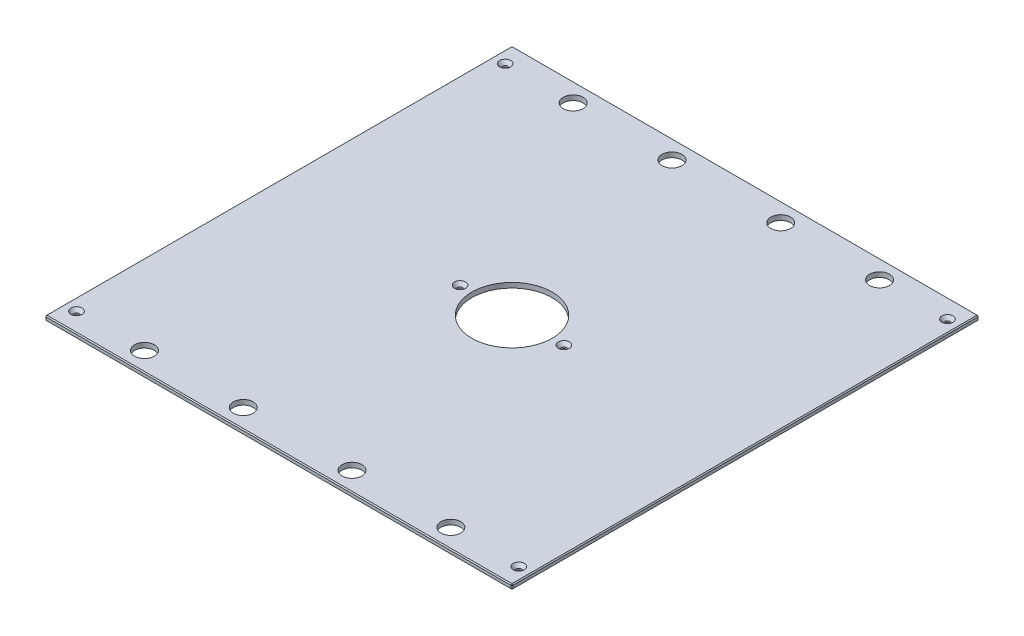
from build123d import *

# Parameters (mm, degrees)
SKETCH1_W                                     = 600.075
SKETCH1_H                                     = 600.075
BOSS_EXTRUDE1_DEPTH                           = 6.35
SKETCH13_R                                    = 51.562
CUT_EXTRUDE6_DEPTH                            = 425.364613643
F_1_1_DIAMETER_HOLE1_D                        = 25.4
CHAMFER2_SIZE                                 = 1.27
CSK_FOR_1_4_FLAT_HEAD_MACHINE_SCREW1_AT_COUNT = 2
CSK_FOR_1_4_FLAT_HEAD_MACHINE_SCREW1_AT_PITCH = 550.85996
CSK_FOR_1_4_FLAT_HEAD_MACHINE_SCREW1_2_COUNT  = 2
CSK_FOR_1_4_FLAT_HEAD_MACHINE_SCREW1_2_PITCH  = 791.479627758
CSK_FOR_1_4_FLAT_HEAD_MACHINE_SCREW1_3_COUNT  = 2
CSK_FOR_1_4_FLAT_HEAD_MACHINE_SCREW1_3_PITCH  = 446.036573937
CSK_FOR_1_4_FLAT_HEAD_MACHINE_SCREW1_4_COUNT  = 2
CSK_FOR_1_4_FLAT_HEAD_MACHINE_SCREW1_4_PITCH  = 350.945133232
CSK_FOR_1_4_FLAT_HEAD_MACHINE_SCREW1_5_COUNT  = 2
CSK_FOR_1_4_FLAT_HEAD_MACHINE_SCREW1_5_PITCH  = 568.325
CSK_FOR_1_4_FLAT_HEAD_MACHINE_SCREW1_6_COUNT  = 2
CSK_FOR_1_4_FLAT_HEAD_MACHINE_SCREW1_6_PITCH  = 481.0125
CSK_FOR_1_4_FLAT_HEAD_MACHINE_SCREW1_7_COUNT  = 2
CSK_FOR_1_4_FLAT_HEAD_MACHINE_SCREW1_7_PITCH  = 731.313695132


with BuildPart() as part:
    # Sketch1 → Boss-Extrude1 (new body)
    with BuildSketch(Plane(origin=(0, 0, 0), x_dir=(1, 0, 0), z_dir=(0, 1, 0))):
        Rectangle(SKETCH1_W, SKETCH1_H)
    extrude(amount=BOSS_EXTRUDE1_DEPTH)

    # Sketch13 → Cut-Extrude6 (cut, through all)
    with BuildSketch(Plane(origin=(0, 6.35, 0), x_dir=(1, 0, 0), z_dir=(0, 1, 0))):
        with Locations(Location((0, 0, 0), (0, 0, 270))):
            Circle(SKETCH13_R)
    extrude(amount=-CUT_EXTRUDE6_DEPTH, mode=Mode.SUBTRACT)

    # 1 _1_ Diameter Hole1 (through all)
    with Locations(Plane(origin=(0, 6.35, 0), x_dir=(1, 0, 0), z_dir=(0, 1, 0))):
        with Locations((196.85, 275.42998), (-196.85, 275.42998), (196.85, -275.42998), (-196.85, -275.42998), (-69.85, 275.42998), (69.85, 275.42998), (69.85, -275.42998), (-69.85, -275.42998)):
            Hole(F_1_1_DIAMETER_HOLE1_D / 2)

    # Chamfer2
    chamfer2_edges = [part.edges().sort_by_distance(p)[0] for p in [
        (300.0375, 6.35, 0),
        (0, 6.35, -300.0375),
        (-300.0375, 6.35, 0),
        (0, 0, -300.0375),
        (300.0375, 0, 0),
        (0, 0, 300.0375),
        (-300.0375, 0, 0),
        (0, 6.35, 300.0375),
        (-300.0375, 3.175, -300.0375),
        (300.0375, 3.175, -300.0375),
        (300.0375, 3.175, 300.0375),
        (-300.0375, 3.175, 300.0375),
    ]]
    chamfer(chamfer2_edges, length=CHAMFER2_SIZE)

    # Sketch24 → CSK for 1_4 Flat Head Machine Screw1 (revolve, cut)
    with BuildSketch(Plane(origin=(284.1625, 6.35, -275.42998), x_dir=(0, 0, 1), z_dir=(1, 0, 0))):
        Polygon((0, 0), (0, 6.35), (3.3782, 6.35), (3.3782, 4.324464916), (7.1374, 0), align=None)
    csk_for_1_4_flat_head_machine_screw1 = revolve(axis=Axis((284.1625, 12.7, -275.42998), (0, -1, 0)), mode=Mode.SUBTRACT)

    # CSK for 1_4 Flat Head Machine Screw1 at: CSK for 1_4 Flat Head Machine Screw1 ×2
    with Locations(*[(0, 0, i * CSK_FOR_1_4_FLAT_HEAD_MACHINE_SCREW1_AT_PITCH) for i in range(1, CSK_FOR_1_4_FLAT_HEAD_MACHINE_SCREW1_AT_COUNT)]):
        add(csk_for_1_4_flat_head_machine_screw1, mode=Mode.SUBTRACT)

    # CSK for 1_4 Flat Head Machine Screw1 2: CSK for 1_4 Flat Head Machine Screw1 ×2
    with Locations(*[Vector(-0.7180538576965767, 0, 0.6959875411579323) * (i * CSK_FOR_1_4_FLAT_HEAD_MACHINE_SCREW1_2_PITCH) for i in range(1, CSK_FOR_1_4_FLAT_HEAD_MACHINE_SCREW1_2_COUNT)]):
        add(csk_for_1_4_flat_head_machine_screw1, mode=Mode.SUBTRACT)

    # CSK for 1_4 Flat Head Machine Screw1 3: CSK for 1_4 Flat Head Machine Screw1 ×2
    with Locations(*[Vector(-0.7865666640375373, 0, 0.6175053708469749) * (i * CSK_FOR_1_4_FLAT_HEAD_MACHINE_SCREW1_3_PITCH) for i in range(1, CSK_FOR_1_4_FLAT_HEAD_MACHINE_SCREW1_3_COUNT)]):
        add(csk_for_1_4_flat_head_machine_screw1, mode=Mode.SUBTRACT)

    # CSK for 1_4 Flat Head Machine Screw1 4: CSK for 1_4 Flat Head Machine Screw1 ×2
    with Locations(*[Vector(-0.6197193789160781, 0, 0.7848234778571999) * (i * CSK_FOR_1_4_FLAT_HEAD_MACHINE_SCREW1_4_PITCH) for i in range(1, CSK_FOR_1_4_FLAT_HEAD_MACHINE_SCREW1_4_COUNT)]):
        add(csk_for_1_4_flat_head_machine_screw1, mode=Mode.SUBTRACT)

    # CSK for 1_4 Flat Head Machine Screw1 5: CSK for 1_4 Flat Head Machine Screw1 ×2
    with Locations(*[(-i * CSK_FOR_1_4_FLAT_HEAD_MACHINE_SCREW1_5_PITCH, 0, 0) for i in range(1, CSK_FOR_1_4_FLAT_HEAD_MACHINE_SCREW1_5_COUNT)]):
        add(csk_for_1_4_flat_head_machine_screw1, mode=Mode.SUBTRACT)

    # CSK for 1_4 Flat Head Machine Screw1 6: CSK for 1_4 Flat Head Machine Screw1 ×2
    with Locations(*[(-i * CSK_FOR_1_4_FLAT_HEAD_MACHINE_SCREW1_6_PITCH, 0, 0) for i in range(1, CSK_FOR_1_4_FLAT_HEAD_MACHINE_SCREW1_6_COUNT)]):
        add(csk_for_1_4_flat_head_machine_screw1, mode=Mode.SUBTRACT)

    # CSK for 1_4 Flat Head Machine Screw1 7: CSK for 1_4 Flat Head Machine Screw1 ×2
    with Locations(*[Vector(-0.6577375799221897, 0, 0.7532471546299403) * (i * CSK_FOR_1_4_FLAT_HEAD_MACHINE_SCREW1_7_PITCH) for i in range(1, CSK_FOR_1_4_FLAT_HEAD_MACHINE_SCREW1_7_COUNT)]):
        add(csk_for_1_4_flat_head_machine_screw1, mode=Mode.SUBTRACT)


solid = part.part
